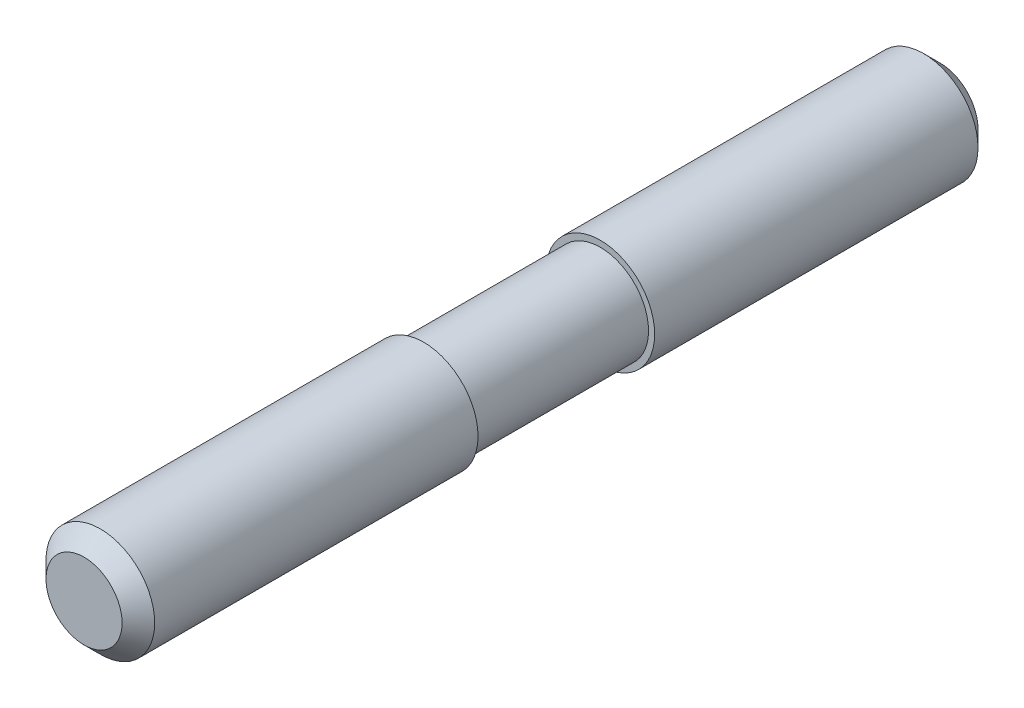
ISO-10303-21;
HEADER;
FILE_DESCRIPTION(('STEP AP214'),'2;1');
FILE_NAME('part.step','',(''),(''),'','','');
FILE_SCHEMA(('AUTOMOTIVE_DESIGN { 1 0 10303 214 1 1 1 1 }'));
ENDSEC;
DATA;
#1=APPLICATION_CONTEXT('core data for automotive mechanical design processes');
#2=APPLICATION_PROTOCOL_DEFINITION('international standard','automotive_design',2000,#1);
#3=PRODUCT_CONTEXT('',#1,'mechanical');
#4=PRODUCT('Part','Part','',(#3));
#5=PRODUCT_RELATED_PRODUCT_CATEGORY('part','',(#4));
#6=PRODUCT_DEFINITION_FORMATION('','',#4);
#7=PRODUCT_DEFINITION_CONTEXT('part definition',#1,'design');
#8=PRODUCT_DEFINITION('design','',#6,#7);
#9=PRODUCT_DEFINITION_SHAPE('','',#8);
#10=(LENGTH_UNIT() NAMED_UNIT(*) SI_UNIT(.MILLI.,.METRE.));
#11=(NAMED_UNIT(*) PLANE_ANGLE_UNIT() SI_UNIT($,.RADIAN.));
#12=(NAMED_UNIT(*) SI_UNIT($,.STERADIAN.) SOLID_ANGLE_UNIT());
#13=UNCERTAINTY_MEASURE_WITH_UNIT(LENGTH_MEASURE(1.E-05),#10,'distance_accuracy_value','');
#14=(GEOMETRIC_REPRESENTATION_CONTEXT(3) GLOBAL_UNCERTAINTY_ASSIGNED_CONTEXT((#13)) GLOBAL_UNIT_ASSIGNED_CONTEXT((#10,
#11,#12)) REPRESENTATION_CONTEXT('',''));
#15=CARTESIAN_POINT('',(0.,0.,0.));
#16=DIRECTION('',(0.,0.,1.));
#17=DIRECTION('',(1.,0.,0.));
#18=AXIS2_PLACEMENT_3D('',#15,#16,#17);
#19=CARTESIAN_POINT('',(0.,0.,0.));
#20=DIRECTION('',(0.,0.,1.));
#21=DIRECTION('',(1.,0.,0.));
#22=AXIS2_PLACEMENT_3D('',#19,#20,#21);
#23=PLANE('',#22);
#24=CARTESIAN_POINT('',(0.,0.,0.));
#25=DIRECTION('',(0.,0.,1.));
#26=DIRECTION('',(1.,0.,0.));
#27=AXIS2_PLACEMENT_3D('',#24,#25,#26);
#28=CIRCLE('',#27,2.8);
#29=CARTESIAN_POINT('',(2.8,0.,0.));
#30=VERTEX_POINT('',#29);
#31=EDGE_CURVE('E8',#30,#30,#28,.T.);
#32=ORIENTED_EDGE('',*,*,#31,.F.);
#33=EDGE_LOOP('',(#32));
#34=FACE_BOUND('',#33,.T.);
#35=ADVANCED_FACE('F12',(#34),#23,.F.);
#36=CARTESIAN_POINT('',(0.,0.,1.2));
#37=DIRECTION('',(0.,0.,1.));
#38=DIRECTION('',(1.,0.,0.));
#39=AXIS2_PLACEMENT_3D('',#36,#37,#38);
#40=CONICAL_SURFACE('',#39,4.,0.785398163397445);
#41=ORIENTED_EDGE('',*,*,#31,.T.);
#42=EDGE_LOOP('',(#41));
#43=FACE_BOUND('',#42,.T.);
#44=CARTESIAN_POINT('',(0.,0.,1.2));
#45=DIRECTION('',(0.,0.,1.));
#46=DIRECTION('',(1.,0.,0.));
#47=AXIS2_PLACEMENT_3D('',#44,#45,#46);
#48=CIRCLE('',#47,4.);
#49=CARTESIAN_POINT('',(4.,0.,1.2));
#50=VERTEX_POINT('',#49);
#51=EDGE_CURVE('E18',#50,#50,#48,.T.);
#52=ORIENTED_EDGE('',*,*,#51,.F.);
#53=EDGE_LOOP('',(#52));
#54=FACE_BOUND('',#53,.T.);
#55=ADVANCED_FACE('F62',(#43,#54),#40,.T.);
#56=CARTESIAN_POINT('',(0.,0.,70.));
#57=DIRECTION('',(0.,0.,1.));
#58=DIRECTION('',(1.,0.,0.));
#59=AXIS2_PLACEMENT_3D('',#56,#57,#58);
#60=CYLINDRICAL_SURFACE('',#59,4.);
#61=CARTESIAN_POINT('',(0.,0.,25.));
#62=DIRECTION('',(0.,0.,1.));
#63=DIRECTION('',(1.,0.,0.));
#64=AXIS2_PLACEMENT_3D('',#61,#62,#63);
#65=CIRCLE('',#64,4.);
#66=CARTESIAN_POINT('',(4.,0.,25.));
#67=VERTEX_POINT('',#66);
#68=EDGE_CURVE('E22',#67,#67,#65,.T.);
#69=ORIENTED_EDGE('',*,*,#68,.F.);
#70=EDGE_LOOP('',(#69));
#71=FACE_BOUND('',#70,.T.);
#72=ORIENTED_EDGE('',*,*,#51,.T.);
#73=EDGE_LOOP('',(#72));
#74=FACE_BOUND('',#73,.T.);
#75=ADVANCED_FACE('F68',(#71,#74),#60,.T.);
#76=CARTESIAN_POINT('',(4.,0.,25.));
#77=DIRECTION('',(0.,0.,-1.));
#78=DIRECTION('',(-1.,0.,0.));
#79=AXIS2_PLACEMENT_3D('',#76,#77,#78);
#80=PLANE('',#79);
#81=CARTESIAN_POINT('',(0.,0.,25.));
#82=DIRECTION('',(0.,0.,1.));
#83=DIRECTION('',(1.,0.,0.));
#84=AXIS2_PLACEMENT_3D('',#81,#82,#83);
#85=CIRCLE('',#84,3.55);
#86=CARTESIAN_POINT('',(3.55,0.,25.));
#87=VERTEX_POINT('',#86);
#88=EDGE_CURVE('E26',#87,#87,#85,.T.);
#89=ORIENTED_EDGE('',*,*,#88,.F.);
#90=EDGE_LOOP('',(#89));
#91=FACE_BOUND('',#90,.T.);
#92=ORIENTED_EDGE('',*,*,#68,.T.);
#93=EDGE_LOOP('',(#92));
#94=FACE_BOUND('',#93,.T.);
#95=ADVANCED_FACE('F73',(#91,#94),#80,.F.);
#96=CARTESIAN_POINT('',(0.,0.,70.));
#97=DIRECTION('',(0.,0.,1.));
#98=DIRECTION('',(1.,0.,0.));
#99=AXIS2_PLACEMENT_3D('',#96,#97,#98);
#100=CYLINDRICAL_SURFACE('',#99,3.55);
#101=CARTESIAN_POINT('',(0.,0.,38.));
#102=DIRECTION('',(0.,0.,1.));
#103=DIRECTION('',(1.,0.,0.));
#104=AXIS2_PLACEMENT_3D('',#101,#102,#103);
#105=CIRCLE('',#104,3.55);
#106=CARTESIAN_POINT('',(3.55,0.,38.));
#107=VERTEX_POINT('',#106);
#108=EDGE_CURVE('E31',#107,#107,#105,.T.);
#109=ORIENTED_EDGE('',*,*,#108,.F.);
#110=EDGE_LOOP('',(#109));
#111=FACE_BOUND('',#110,.T.);
#112=ORIENTED_EDGE('',*,*,#88,.T.);
#113=EDGE_LOOP('',(#112));
#114=FACE_BOUND('',#113,.T.);
#115=ADVANCED_FACE('F80',(#111,#114),#100,.T.);
#116=CARTESIAN_POINT('',(3.55,0.,38.));
#117=DIRECTION('',(0.,0.,1.));
#118=DIRECTION('',(1.,0.,0.));
#119=AXIS2_PLACEMENT_3D('',#116,#117,#118);
#120=PLANE('',#119);
#121=CARTESIAN_POINT('',(0.,0.,38.));
#122=DIRECTION('',(0.,0.,1.));
#123=DIRECTION('',(1.,0.,0.));
#124=AXIS2_PLACEMENT_3D('',#121,#122,#123);
#125=CIRCLE('',#124,4.);
#126=CARTESIAN_POINT('',(4.,0.,38.));
#127=VERTEX_POINT('',#126);
#128=EDGE_CURVE('E34',#127,#127,#125,.T.);
#129=ORIENTED_EDGE('',*,*,#128,.F.);
#130=EDGE_LOOP('',(#129));
#131=FACE_BOUND('',#130,.T.);
#132=ORIENTED_EDGE('',*,*,#108,.T.);
#133=EDGE_LOOP('',(#132));
#134=FACE_BOUND('',#133,.T.);
#135=ADVANCED_FACE('F58',(#131,#134),#120,.F.);
#136=CARTESIAN_POINT('',(0.,0.,70.));
#137=DIRECTION('',(0.,0.,1.));
#138=DIRECTION('',(1.,0.,0.));
#139=AXIS2_PLACEMENT_3D('',#136,#137,#138);
#140=CYLINDRICAL_SURFACE('',#139,4.);
#141=CARTESIAN_POINT('',(0.,0.,61.8));
#142=DIRECTION('',(0.,0.,1.));
#143=DIRECTION('',(1.,0.,0.));
#144=AXIS2_PLACEMENT_3D('',#141,#142,#143);
#145=CIRCLE('',#144,4.);
#146=CARTESIAN_POINT('',(4.,0.,61.8));
#147=VERTEX_POINT('',#146);
#148=EDGE_CURVE('E37',#147,#147,#145,.T.);
#149=ORIENTED_EDGE('',*,*,#148,.F.);
#150=EDGE_LOOP('',(#149));
#151=FACE_BOUND('',#150,.T.);
#152=ORIENTED_EDGE('',*,*,#128,.T.);
#153=EDGE_LOOP('',(#152));
#154=FACE_BOUND('',#153,.T.);
#155=ADVANCED_FACE('F48',(#151,#154),#140,.T.);
#156=CARTESIAN_POINT('',(0.,0.,63.));
#157=DIRECTION('',(0.,0.,-1.));
#158=DIRECTION('',(-1.,0.,0.));
#159=AXIS2_PLACEMENT_3D('',#156,#157,#158);
#160=CONICAL_SURFACE('',#159,2.8,0.785398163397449);
#161=ORIENTED_EDGE('',*,*,#148,.T.);
#162=EDGE_LOOP('',(#161));
#163=FACE_BOUND('',#162,.T.);
#164=CARTESIAN_POINT('',(0.,0.,63.));
#165=DIRECTION('',(0.,0.,1.));
#166=DIRECTION('',(1.,0.,0.));
#167=AXIS2_PLACEMENT_3D('',#164,#165,#166);
#168=CIRCLE('',#167,2.8);
#169=CARTESIAN_POINT('',(2.8,0.,63.));
#170=VERTEX_POINT('',#169);
#171=EDGE_CURVE('E40',#170,#170,#168,.T.);
#172=ORIENTED_EDGE('',*,*,#171,.F.);
#173=EDGE_LOOP('',(#172));
#174=FACE_BOUND('',#173,.T.);
#175=ADVANCED_FACE('F46',(#163,#174),#160,.T.);
#176=CARTESIAN_POINT('',(2.8,0.,63.));
#177=DIRECTION('',(0.,0.,-1.));
#178=DIRECTION('',(-1.,0.,0.));
#179=AXIS2_PLACEMENT_3D('',#176,#177,#178);
#180=PLANE('',#179);
#181=ORIENTED_EDGE('',*,*,#171,.T.);
#182=EDGE_LOOP('',(#181));
#183=FACE_BOUND('',#182,.T.);
#184=ADVANCED_FACE('F44',(#183),#180,.F.);
#185=CLOSED_SHELL('',(#35,#55,#75,#95,#115,#135,#155,#175,#184));
#186=MANIFOLD_SOLID_BREP('B1',#185);
#187=ADVANCED_BREP_SHAPE_REPRESENTATION('',(#18,#186),#14);
#188=SHAPE_DEFINITION_REPRESENTATION(#9,#187);
ENDSEC;
END-ISO-10303-21;
